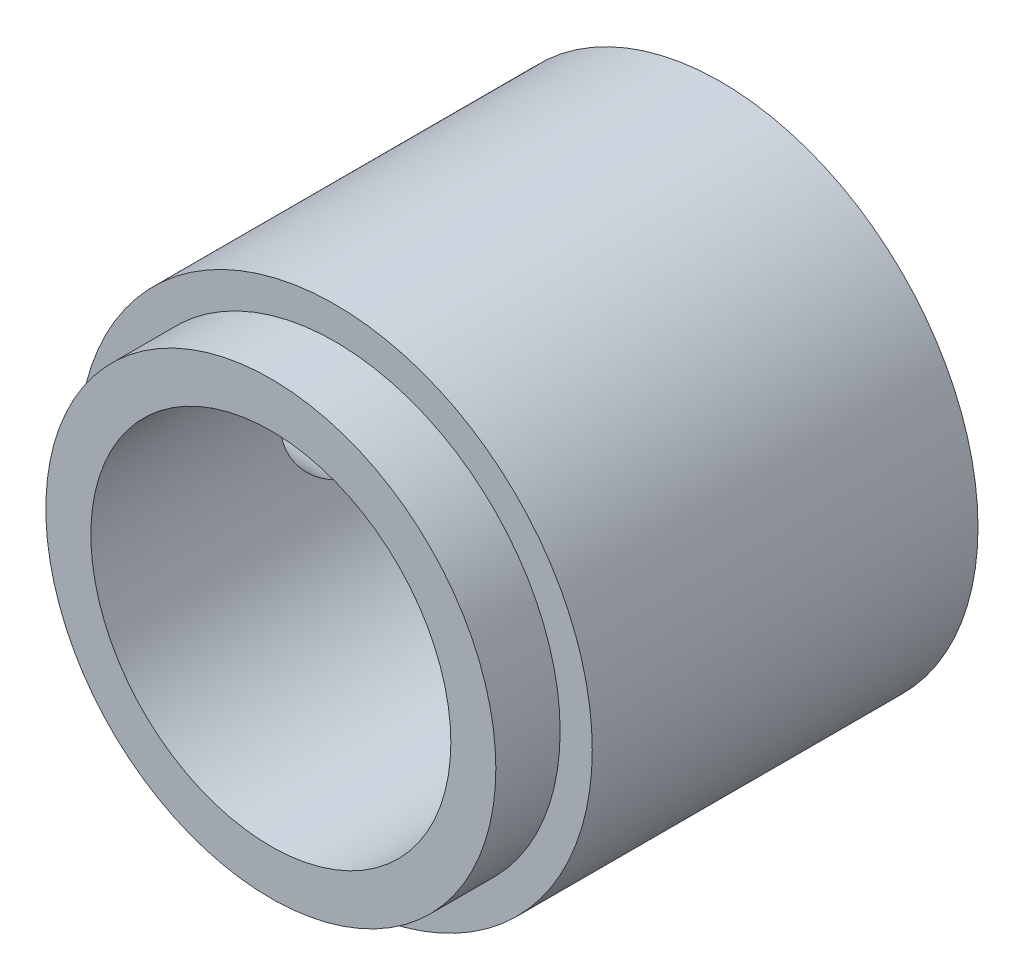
from build123d import *

# Parameters (mm, degrees)
ESQUISSE1_R             = 20
ESQUISSE1_R_2           = 14
BASE_EXTRUSION_DEPTH    = 30
ESQUISSE2_R             = 17.5
ESQUISSE2_R_2           = 14
BOSS_EXTRU_1_DEPTH      = 5
ESQUISSE3_R             = 5.25
ENL_V_MAT_EXTRU_1_DEPTH = 25


with BuildPart() as part:
    # Esquisse1 → Base-Extrusion (new body)
    with BuildSketch(Plane.XY):
        Circle(ESQUISSE1_R)
        Circle(ESQUISSE1_R_2, mode=Mode.SUBTRACT)
    extrude(amount=BASE_EXTRUSION_DEPTH)

    # Esquisse2 → Boss.-Extru.1 (add)
    with BuildSketch(Plane.XY.offset(30)):
        Circle(ESQUISSE2_R)
        Circle(ESQUISSE2_R_2, mode=Mode.SUBTRACT)
    extrude(amount=BOSS_EXTRU_1_DEPTH)

    # Esquisse3 → Enl_v. mat.-Extru.1 (cut)
    with BuildSketch(Plane(origin=(0, 0, 0), x_dir=(0, 0, -1), z_dir=(1, 0, 0))):
        with Locations(Location((-15, 0, 0), (0, 0, 180))):
            Circle(ESQUISSE3_R)
    extrude(amount=-ENL_V_MAT_EXTRU_1_DEPTH, mode=Mode.SUBTRACT)


solid = part.part
